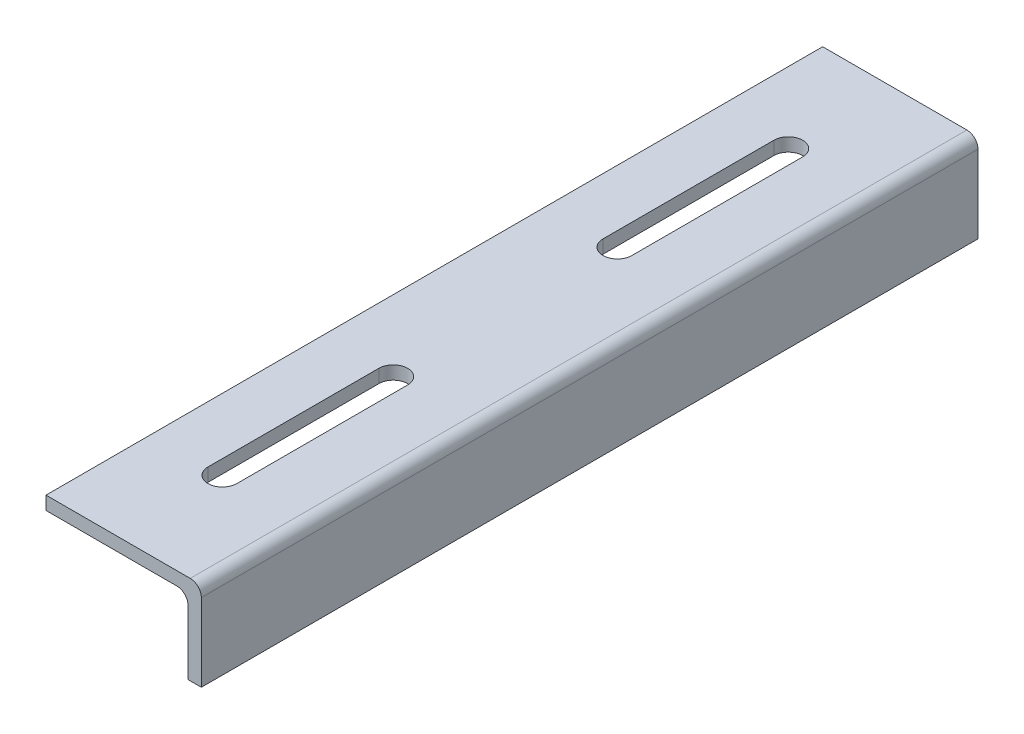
ISO-10303-21;
HEADER;
FILE_DESCRIPTION(('STEP AP214'),'2;1');
FILE_NAME('part.step','',(''),(''),'','','');
FILE_SCHEMA(('AUTOMOTIVE_DESIGN { 1 0 10303 214 1 1 1 1 }'));
ENDSEC;
DATA;
#1=APPLICATION_CONTEXT('core data for automotive mechanical design processes');
#2=APPLICATION_PROTOCOL_DEFINITION('international standard','automotive_design',2000,#1);
#3=PRODUCT_CONTEXT('',#1,'mechanical');
#4=PRODUCT('Part','Part','',(#3));
#5=PRODUCT_RELATED_PRODUCT_CATEGORY('part','',(#4));
#6=PRODUCT_DEFINITION_FORMATION('','',#4);
#7=PRODUCT_DEFINITION_CONTEXT('part definition',#1,'design');
#8=PRODUCT_DEFINITION('design','',#6,#7);
#9=PRODUCT_DEFINITION_SHAPE('','',#8);
#10=(LENGTH_UNIT() NAMED_UNIT(*) SI_UNIT(.MILLI.,.METRE.));
#11=(NAMED_UNIT(*) PLANE_ANGLE_UNIT() SI_UNIT($,.RADIAN.));
#12=(NAMED_UNIT(*) SI_UNIT($,.STERADIAN.) SOLID_ANGLE_UNIT());
#13=UNCERTAINTY_MEASURE_WITH_UNIT(LENGTH_MEASURE(1.E-05),#10,'distance_accuracy_value','');
#14=(GEOMETRIC_REPRESENTATION_CONTEXT(3) GLOBAL_UNCERTAINTY_ASSIGNED_CONTEXT((#13)) GLOBAL_UNIT_ASSIGNED_CONTEXT((#10,
#11,#12)) REPRESENTATION_CONTEXT('',''));
#15=CARTESIAN_POINT('',(0.,0.,0.));
#16=DIRECTION('',(0.,0.,1.));
#17=DIRECTION('',(1.,0.,0.));
#18=AXIS2_PLACEMENT_3D('',#15,#16,#17);
#19=CARTESIAN_POINT('',(-70.0000000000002,-6.00000000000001,350.000000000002));
#20=DIRECTION('',(1.,0.,0.));
#21=DIRECTION('',(0.,0.,-1.));
#22=AXIS2_PLACEMENT_3D('',#19,#20,#21);
#23=PLANE('',#22);
#24=DIRECTION('',(0.,-1.,0.));
#25=VECTOR('',#24,1.);
#26=CARTESIAN_POINT('',(-70.0000000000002,-6.00000000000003,0.));
#27=LINE('',#26,#25);
#28=CARTESIAN_POINT('',(-70.0000000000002,0.,0.));
#29=VERTEX_POINT('',#28);
#30=CARTESIAN_POINT('',(-70.0000000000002,-6.00000000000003,0.));
#31=VERTEX_POINT('',#30);
#32=EDGE_CURVE('E232',#29,#31,#27,.T.);
#33=ORIENTED_EDGE('',*,*,#32,.T.);
#34=DIRECTION('',(0.,0.,-1.));
#35=VECTOR('',#34,1.);
#36=CARTESIAN_POINT('',(-70.0000000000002,-6.00000000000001,350.000000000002));
#37=LINE('',#36,#35);
#38=CARTESIAN_POINT('',(-70.0000000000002,-6.00000000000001,350.000000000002));
#39=VERTEX_POINT('',#38);
#40=EDGE_CURVE('E269',#39,#31,#37,.T.);
#41=ORIENTED_EDGE('',*,*,#40,.F.);
#42=DIRECTION('',(0.,-1.,0.));
#43=VECTOR('',#42,1.);
#44=CARTESIAN_POINT('',(-70.0000000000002,-6.00000000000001,350.000000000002));
#45=LINE('',#44,#43);
#46=CARTESIAN_POINT('',(-70.0000000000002,0.,350.000000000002));
#47=VERTEX_POINT('',#46);
#48=EDGE_CURVE('E246',#47,#39,#45,.T.);
#49=ORIENTED_EDGE('',*,*,#48,.F.);
#50=DIRECTION('',(0.,0.,-1.));
#51=VECTOR('',#50,1.);
#52=CARTESIAN_POINT('',(-70.0000000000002,0.,350.000000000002));
#53=LINE('',#52,#51);
#54=EDGE_CURVE('E260',#47,#29,#53,.T.);
#55=ORIENTED_EDGE('',*,*,#54,.T.);
#56=EDGE_LOOP('',(#33,#41,#49,#55));
#57=FACE_BOUND('',#56,.T.);
#58=ADVANCED_FACE('F43',(#57),#23,.F.);
#59=CARTESIAN_POINT('',(-5.99999999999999,-6.00000000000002,350.000000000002));
#60=DIRECTION('',(0.,1.,0.));
#61=DIRECTION('',(-1.,0.,0.));
#62=AXIS2_PLACEMENT_3D('',#59,#60,#61);
#63=PLANE('',#62);
#64=DIRECTION('',(0.,0.,-1.));
#65=VECTOR('',#64,1.);
#66=CARTESIAN_POINT('',(-31.5000000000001,-6.00000000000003,350.000000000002));
#67=LINE('',#66,#65);
#68=CARTESIAN_POINT('',(-31.5,-6.00000000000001,124.500000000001));
#69=VERTEX_POINT('',#68);
#70=CARTESIAN_POINT('',(-31.5,-6.00000000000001,47.5000000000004));
#71=VERTEX_POINT('',#70);
#72=EDGE_CURVE('E194',#69,#71,#67,.T.);
#73=ORIENTED_EDGE('',*,*,#72,.T.);
#74=CARTESIAN_POINT('',(-38.,-6.00000000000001,47.5000000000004));
#75=DIRECTION('',(0.,1.,0.));
#76=DIRECTION('',(-1.,0.,0.));
#77=AXIS2_PLACEMENT_3D('',#74,#75,#76);
#78=CIRCLE('',#77,6.5);
#79=CARTESIAN_POINT('',(-44.5,-6.00000000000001,47.5000000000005));
#80=VERTEX_POINT('',#79);
#81=EDGE_CURVE('E197',#71,#80,#78,.T.);
#82=ORIENTED_EDGE('',*,*,#81,.T.);
#83=DIRECTION('',(0.,0.,1.));
#84=VECTOR('',#83,1.);
#85=CARTESIAN_POINT('',(-44.5000000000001,-6.00000000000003,350.000000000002));
#86=LINE('',#85,#84);
#87=CARTESIAN_POINT('',(-44.5,-6.00000000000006,124.500000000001));
#88=VERTEX_POINT('',#87);
#89=EDGE_CURVE('E189',#80,#88,#86,.T.);
#90=ORIENTED_EDGE('',*,*,#89,.T.);
#91=CARTESIAN_POINT('',(-38.,-6.00000000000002,124.500000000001));
#92=DIRECTION('',(0.,1.,0.));
#93=DIRECTION('',(-1.,0.,0.));
#94=AXIS2_PLACEMENT_3D('',#91,#92,#93);
#95=CIRCLE('',#94,6.49999999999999);
#96=EDGE_CURVE('E164',#88,#69,#95,.T.);
#97=ORIENTED_EDGE('',*,*,#96,.T.);
#98=EDGE_LOOP('',(#73,#82,#90,#97));
#99=FACE_BOUND('',#98,.T.);
#100=DIRECTION('',(0.,0.,-1.));
#101=VECTOR('',#100,1.);
#102=CARTESIAN_POINT('',(-31.5000000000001,-6.00000000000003,350.000000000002));
#103=LINE('',#102,#101);
#104=CARTESIAN_POINT('',(-31.5000000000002,-6.00000000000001,302.500000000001));
#105=VERTEX_POINT('',#104);
#106=CARTESIAN_POINT('',(-31.5000000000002,-6.00000000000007,225.500000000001));
#107=VERTEX_POINT('',#106);
#108=EDGE_CURVE('E226',#105,#107,#103,.T.);
#109=ORIENTED_EDGE('',*,*,#108,.T.);
#110=CARTESIAN_POINT('',(-38.0000000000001,-6.00000000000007,225.500000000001));
#111=DIRECTION('',(0.,1.,0.));
#112=DIRECTION('',(-1.,0.,0.));
#113=AXIS2_PLACEMENT_3D('',#110,#111,#112);
#114=CIRCLE('',#113,6.5);
#115=CARTESIAN_POINT('',(-44.5000000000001,-6.00000000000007,225.500000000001));
#116=VERTEX_POINT('',#115);
#117=EDGE_CURVE('E229',#107,#116,#114,.T.);
#118=ORIENTED_EDGE('',*,*,#117,.T.);
#119=DIRECTION('',(0.,0.,1.));
#120=VECTOR('',#119,1.);
#121=CARTESIAN_POINT('',(-44.5000000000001,-6.00000000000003,350.000000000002));
#122=LINE('',#121,#120);
#123=CARTESIAN_POINT('',(-44.5000000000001,-6.00000000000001,302.500000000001));
#124=VERTEX_POINT('',#123);
#125=EDGE_CURVE('E214',#116,#124,#122,.T.);
#126=ORIENTED_EDGE('',*,*,#125,.T.);
#127=CARTESIAN_POINT('',(-38.0000000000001,-6.00000000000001,302.500000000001));
#128=DIRECTION('',(0.,1.,0.));
#129=DIRECTION('',(-1.,0.,0.));
#130=AXIS2_PLACEMENT_3D('',#127,#128,#129);
#131=CIRCLE('',#130,6.49999999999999);
#132=EDGE_CURVE('E223',#124,#105,#131,.T.);
#133=ORIENTED_EDGE('',*,*,#132,.T.);
#134=EDGE_LOOP('',(#109,#118,#126,#133));
#135=FACE_BOUND('',#134,.T.);
#136=DIRECTION('',(1.,0.,0.));
#137=VECTOR('',#136,1.);
#138=CARTESIAN_POINT('',(-5.99999999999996,-6.00000000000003,0.));
#139=LINE('',#138,#137);
#140=CARTESIAN_POINT('',(-11.,-6.00000000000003,0.));
#141=VERTEX_POINT('',#140);
#142=EDGE_CURVE('E235',#31,#141,#139,.T.);
#143=ORIENTED_EDGE('',*,*,#142,.T.);
#144=DIRECTION('',(0.,0.,-1.));
#145=VECTOR('',#144,1.);
#146=CARTESIAN_POINT('',(-11.,-6.00000000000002,350.000000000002));
#147=LINE('',#146,#145);
#148=CARTESIAN_POINT('',(-11.,-6.00000000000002,350.000000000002));
#149=VERTEX_POINT('',#148);
#150=EDGE_CURVE('E275',#141,#149,#147,.F.);
#151=ORIENTED_EDGE('',*,*,#150,.T.);
#152=DIRECTION('',(1.,0.,0.));
#153=VECTOR('',#152,1.);
#154=CARTESIAN_POINT('',(-5.99999999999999,-6.00000000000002,350.000000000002));
#155=LINE('',#154,#153);
#156=EDGE_CURVE('E249',#39,#149,#155,.T.);
#157=ORIENTED_EDGE('',*,*,#156,.F.);
#158=ORIENTED_EDGE('',*,*,#40,.T.);
#159=EDGE_LOOP('',(#143,#151,#157,#158));
#160=FACE_BOUND('',#159,.T.);
#161=ADVANCED_FACE('F291',(#99,#135,#160),#63,.F.);
#162=CARTESIAN_POINT('',(-5.99999999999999,-40.,350.000000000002));
#163=DIRECTION('',(1.,0.,0.));
#164=DIRECTION('',(0.,0.,-1.));
#165=AXIS2_PLACEMENT_3D('',#162,#163,#164);
#166=PLANE('',#165);
#167=DIRECTION('',(0.,-1.,0.));
#168=VECTOR('',#167,1.);
#169=CARTESIAN_POINT('',(-5.99999999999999,-40.,350.000000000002));
#170=LINE('',#169,#168);
#171=CARTESIAN_POINT('',(-5.99999999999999,-11.,350.000000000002));
#172=VERTEX_POINT('',#171);
#173=CARTESIAN_POINT('',(-5.99999999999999,-40.,350.000000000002));
#174=VERTEX_POINT('',#173);
#175=EDGE_CURVE('E252',#172,#174,#170,.T.);
#176=ORIENTED_EDGE('',*,*,#175,.F.);
#177=DIRECTION('',(0.,0.,-1.));
#178=VECTOR('',#177,1.);
#179=CARTESIAN_POINT('',(-5.99999999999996,-11.,0.));
#180=LINE('',#179,#178);
#181=CARTESIAN_POINT('',(-5.99999999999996,-11.,0.));
#182=VERTEX_POINT('',#181);
#183=EDGE_CURVE('E272',#172,#182,#180,.T.);
#184=ORIENTED_EDGE('',*,*,#183,.T.);
#185=DIRECTION('',(0.,-1.,0.));
#186=VECTOR('',#185,1.);
#187=CARTESIAN_POINT('',(-5.99999999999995,-40.,0.));
#188=LINE('',#187,#186);
#189=CARTESIAN_POINT('',(-5.99999999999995,-40.,0.));
#190=VERTEX_POINT('',#189);
#191=EDGE_CURVE('E238',#182,#190,#188,.T.);
#192=ORIENTED_EDGE('',*,*,#191,.T.);
#193=DIRECTION('',(0.,0.,-1.));
#194=VECTOR('',#193,1.);
#195=CARTESIAN_POINT('',(-5.99999999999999,-40.,350.000000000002));
#196=LINE('',#195,#194);
#197=EDGE_CURVE('E266',#174,#190,#196,.T.);
#198=ORIENTED_EDGE('',*,*,#197,.F.);
#199=EDGE_LOOP('',(#176,#184,#192,#198));
#200=FACE_BOUND('',#199,.T.);
#201=ADVANCED_FACE('F300',(#200),#166,.F.);
#202=CARTESIAN_POINT('',(0.,-40.,350.000000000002));
#203=DIRECTION('',(0.,1.,0.));
#204=DIRECTION('',(0.,0.,1.));
#205=AXIS2_PLACEMENT_3D('',#202,#203,#204);
#206=PLANE('',#205);
#207=DIRECTION('',(1.,0.,0.));
#208=VECTOR('',#207,1.);
#209=CARTESIAN_POINT('',(0.,-40.,0.));
#210=LINE('',#209,#208);
#211=CARTESIAN_POINT('',(0.,-40.,0.));
#212=VERTEX_POINT('',#211);
#213=EDGE_CURVE('E240',#190,#212,#210,.T.);
#214=ORIENTED_EDGE('',*,*,#213,.T.);
#215=DIRECTION('',(0.,0.,-1.));
#216=VECTOR('',#215,1.);
#217=CARTESIAN_POINT('',(0.,-40.,350.000000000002));
#218=LINE('',#217,#216);
#219=CARTESIAN_POINT('',(0.,-40.,350.000000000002));
#220=VERTEX_POINT('',#219);
#221=EDGE_CURVE('E263',#220,#212,#218,.T.);
#222=ORIENTED_EDGE('',*,*,#221,.F.);
#223=DIRECTION('',(1.,0.,0.));
#224=VECTOR('',#223,1.);
#225=CARTESIAN_POINT('',(0.,-40.,350.000000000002));
#226=LINE('',#225,#224);
#227=EDGE_CURVE('E254',#174,#220,#226,.T.);
#228=ORIENTED_EDGE('',*,*,#227,.F.);
#229=ORIENTED_EDGE('',*,*,#197,.T.);
#230=EDGE_LOOP('',(#214,#222,#228,#229));
#231=FACE_BOUND('',#230,.T.);
#232=ADVANCED_FACE('F304',(#231),#206,.F.);
#233=CARTESIAN_POINT('',(0.,0.,350.000000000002));
#234=DIRECTION('',(-1.,0.,0.));
#235=DIRECTION('',(0.,-1.,0.));
#236=AXIS2_PLACEMENT_3D('',#233,#234,#235);
#237=PLANE('',#236);
#238=DIRECTION('',(0.,1.,0.));
#239=VECTOR('',#238,1.);
#240=CARTESIAN_POINT('',(0.,0.,0.));
#241=LINE('',#240,#239);
#242=CARTESIAN_POINT('',(0.,-5.00000000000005,0.));
#243=VERTEX_POINT('',#242);
#244=EDGE_CURVE('E242',#212,#243,#241,.T.);
#245=ORIENTED_EDGE('',*,*,#244,.T.);
#246=DIRECTION('',(0.,0.,-1.));
#247=VECTOR('',#246,1.);
#248=CARTESIAN_POINT('',(0.,-5.00000000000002,350.000000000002));
#249=LINE('',#248,#247);
#250=CARTESIAN_POINT('',(0.,-5.00000000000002,350.000000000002));
#251=VERTEX_POINT('',#250);
#252=EDGE_CURVE('E57',#243,#251,#249,.F.);
#253=ORIENTED_EDGE('',*,*,#252,.T.);
#254=DIRECTION('',(0.,1.,0.));
#255=VECTOR('',#254,1.);
#256=CARTESIAN_POINT('',(0.,0.,350.000000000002));
#257=LINE('',#256,#255);
#258=EDGE_CURVE('E256',#220,#251,#257,.T.);
#259=ORIENTED_EDGE('',*,*,#258,.F.);
#260=ORIENTED_EDGE('',*,*,#221,.T.);
#261=EDGE_LOOP('',(#245,#253,#259,#260));
#262=FACE_BOUND('',#261,.T.);
#263=ADVANCED_FACE('F327',(#262),#237,.F.);
#264=CARTESIAN_POINT('',(-70.0000000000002,0.,350.000000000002));
#265=DIRECTION('',(0.,-1.,0.));
#266=DIRECTION('',(0.,0.,-1.));
#267=AXIS2_PLACEMENT_3D('',#264,#265,#266);
#268=PLANE('',#267);
#269=DIRECTION('',(0.,0.,1.));
#270=VECTOR('',#269,1.);
#271=CARTESIAN_POINT('',(-44.5,0.,47.5000000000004));
#272=LINE('',#271,#270);
#273=CARTESIAN_POINT('',(-44.5,0.,47.5000000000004));
#274=VERTEX_POINT('',#273);
#275=CARTESIAN_POINT('',(-44.5,0.,124.500000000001));
#276=VERTEX_POINT('',#275);
#277=EDGE_CURVE('E172',#274,#276,#272,.T.);
#278=ORIENTED_EDGE('',*,*,#277,.F.);
#279=CARTESIAN_POINT('',(-38.,0.,47.5000000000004));
#280=DIRECTION('',(0.,1.,0.));
#281=DIRECTION('',(0.,0.,1.));
#282=AXIS2_PLACEMENT_3D('',#279,#280,#281);
#283=CIRCLE('',#282,6.5);
#284=CARTESIAN_POINT('',(-31.5000000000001,0.,47.5000000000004));
#285=VERTEX_POINT('',#284);
#286=EDGE_CURVE('E177',#285,#274,#283,.T.);
#287=ORIENTED_EDGE('',*,*,#286,.F.);
#288=DIRECTION('',(0.,0.,-1.));
#289=VECTOR('',#288,1.);
#290=CARTESIAN_POINT('',(-31.5000000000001,0.,47.5000000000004));
#291=LINE('',#290,#289);
#292=CARTESIAN_POINT('',(-31.5000000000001,0.,124.500000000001));
#293=VERTEX_POINT('',#292);
#294=EDGE_CURVE('E182',#293,#285,#291,.T.);
#295=ORIENTED_EDGE('',*,*,#294,.F.);
#296=CARTESIAN_POINT('',(-38.,0.,124.500000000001));
#297=DIRECTION('',(0.,1.,0.));
#298=DIRECTION('',(0.,0.,1.));
#299=AXIS2_PLACEMENT_3D('',#296,#297,#298);
#300=CIRCLE('',#299,6.49999999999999);
#301=EDGE_CURVE('E161',#276,#293,#300,.T.);
#302=ORIENTED_EDGE('',*,*,#301,.F.);
#303=EDGE_LOOP('',(#278,#287,#295,#302));
#304=FACE_BOUND('',#303,.T.);
#305=DIRECTION('',(0.,0.,1.));
#306=VECTOR('',#305,1.);
#307=CARTESIAN_POINT('',(-44.5000000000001,0.,225.500000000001));
#308=LINE('',#307,#306);
#309=CARTESIAN_POINT('',(-44.5000000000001,0.,225.500000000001));
#310=VERTEX_POINT('',#309);
#311=CARTESIAN_POINT('',(-44.5000000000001,0.,302.500000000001));
#312=VERTEX_POINT('',#311);
#313=EDGE_CURVE('E202',#310,#312,#308,.T.);
#314=ORIENTED_EDGE('',*,*,#313,.F.);
#315=CARTESIAN_POINT('',(-38.0000000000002,0.,225.500000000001));
#316=DIRECTION('',(0.,1.,0.));
#317=DIRECTION('',(0.,0.,1.));
#318=AXIS2_PLACEMENT_3D('',#315,#316,#317);
#319=CIRCLE('',#318,6.5);
#320=CARTESIAN_POINT('',(-31.5000000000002,0.,225.500000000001));
#321=VERTEX_POINT('',#320);
#322=EDGE_CURVE('E200',#321,#310,#319,.T.);
#323=ORIENTED_EDGE('',*,*,#322,.F.);
#324=DIRECTION('',(0.,0.,-1.));
#325=VECTOR('',#324,1.);
#326=CARTESIAN_POINT('',(-31.5000000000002,0.,225.500000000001));
#327=LINE('',#326,#325);
#328=CARTESIAN_POINT('',(-31.5000000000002,0.,302.500000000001));
#329=VERTEX_POINT('',#328);
#330=EDGE_CURVE('E208',#329,#321,#327,.T.);
#331=ORIENTED_EDGE('',*,*,#330,.F.);
#332=CARTESIAN_POINT('',(-38.0000000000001,0.,302.500000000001));
#333=DIRECTION('',(0.,1.,0.));
#334=DIRECTION('',(0.,0.,1.));
#335=AXIS2_PLACEMENT_3D('',#332,#333,#334);
#336=CIRCLE('',#335,6.49999999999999);
#337=EDGE_CURVE('E205',#312,#329,#336,.T.);
#338=ORIENTED_EDGE('',*,*,#337,.F.);
#339=EDGE_LOOP('',(#314,#323,#331,#338));
#340=FACE_BOUND('',#339,.T.);
#341=DIRECTION('',(-1.,0.,0.));
#342=VECTOR('',#341,1.);
#343=CARTESIAN_POINT('',(-70.0000000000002,0.,350.000000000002));
#344=LINE('',#343,#342);
#345=CARTESIAN_POINT('',(-5.00000000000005,0.,350.000000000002));
#346=VERTEX_POINT('',#345);
#347=EDGE_CURVE('E258',#346,#47,#344,.T.);
#348=ORIENTED_EDGE('',*,*,#347,.F.);
#349=DIRECTION('',(0.,0.,-1.));
#350=VECTOR('',#349,1.);
#351=CARTESIAN_POINT('',(-5.00000000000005,0.,350.000000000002));
#352=LINE('',#351,#350);
#353=CARTESIAN_POINT('',(-5.,0.,0.));
#354=VERTEX_POINT('',#353);
#355=EDGE_CURVE('E277',#346,#354,#352,.T.);
#356=ORIENTED_EDGE('',*,*,#355,.T.);
#357=DIRECTION('',(-1.,0.,0.));
#358=VECTOR('',#357,1.);
#359=CARTESIAN_POINT('',(-70.0000000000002,0.,0.));
#360=LINE('',#359,#358);
#361=EDGE_CURVE('E244',#354,#29,#360,.T.);
#362=ORIENTED_EDGE('',*,*,#361,.T.);
#363=ORIENTED_EDGE('',*,*,#54,.F.);
#364=EDGE_LOOP('',(#348,#356,#362,#363));
#365=FACE_BOUND('',#364,.T.);
#366=ADVANCED_FACE('F179',(#304,#340,#365),#268,.F.);
#367=CARTESIAN_POINT('',(-70.0000000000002,0.,350.000000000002));
#368=DIRECTION('',(0.,0.,-1.));
#369=DIRECTION('',(-1.,0.,0.));
#370=AXIS2_PLACEMENT_3D('',#367,#368,#369);
#371=PLANE('',#370);
#372=ORIENTED_EDGE('',*,*,#258,.T.);
#373=CARTESIAN_POINT('',(-5.00000000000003,-5.00000000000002,350.000000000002));
#374=DIRECTION('',(0.,0.,-1.));
#375=DIRECTION('',(-1.,0.,0.));
#376=AXIS2_PLACEMENT_3D('',#373,#374,#375);
#377=CIRCLE('',#376,5.);
#378=EDGE_CURVE('E282',#251,#346,#377,.F.);
#379=ORIENTED_EDGE('',*,*,#378,.T.);
#380=ORIENTED_EDGE('',*,*,#347,.T.);
#381=ORIENTED_EDGE('',*,*,#48,.T.);
#382=ORIENTED_EDGE('',*,*,#156,.T.);
#383=CARTESIAN_POINT('',(-11.,-11.0000000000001,350.000000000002));
#384=DIRECTION('',(0.,0.,-1.));
#385=DIRECTION('',(-1.,0.,0.));
#386=AXIS2_PLACEMENT_3D('',#383,#384,#385);
#387=CIRCLE('',#386,5.);
#388=EDGE_CURVE('E11',#149,#172,#387,.T.);
#389=ORIENTED_EDGE('',*,*,#388,.T.);
#390=ORIENTED_EDGE('',*,*,#175,.T.);
#391=ORIENTED_EDGE('',*,*,#227,.T.);
#392=EDGE_LOOP('',(#372,#379,#380,#381,#382,#389,#390,#391));
#393=FACE_BOUND('',#392,.T.);
#394=ADVANCED_FACE('F297',(#393),#371,.F.);
#395=CARTESIAN_POINT('',(-70.0000000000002,0.,0.));
#396=DIRECTION('',(0.,0.,-1.));
#397=DIRECTION('',(-1.,0.,0.));
#398=AXIS2_PLACEMENT_3D('',#395,#396,#397);
#399=PLANE('',#398);
#400=ORIENTED_EDGE('',*,*,#361,.F.);
#401=CARTESIAN_POINT('',(-5.,-5.00000000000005,0.));
#402=DIRECTION('',(0.,0.,-1.));
#403=DIRECTION('',(-1.,0.,0.));
#404=AXIS2_PLACEMENT_3D('',#401,#402,#403);
#405=CIRCLE('',#404,5.);
#406=EDGE_CURVE('E65',#354,#243,#405,.T.);
#407=ORIENTED_EDGE('',*,*,#406,.T.);
#408=ORIENTED_EDGE('',*,*,#244,.F.);
#409=ORIENTED_EDGE('',*,*,#213,.F.);
#410=ORIENTED_EDGE('',*,*,#191,.F.);
#411=CARTESIAN_POINT('',(-11.,-11.,0.));
#412=DIRECTION('',(0.,0.,-1.));
#413=DIRECTION('',(-1.,0.,0.));
#414=AXIS2_PLACEMENT_3D('',#411,#412,#413);
#415=CIRCLE('',#414,5.);
#416=EDGE_CURVE('E50',#182,#141,#415,.F.);
#417=ORIENTED_EDGE('',*,*,#416,.T.);
#418=ORIENTED_EDGE('',*,*,#142,.F.);
#419=ORIENTED_EDGE('',*,*,#32,.F.);
#420=EDGE_LOOP('',(#400,#407,#408,#409,#410,#417,#418,#419));
#421=FACE_BOUND('',#420,.T.);
#422=ADVANCED_FACE('F284',(#421),#399,.T.);
#423=CARTESIAN_POINT('',(-38.,-350.000000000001,225.500000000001));
#424=DIRECTION('',(0.,1.,0.));
#425=DIRECTION('',(0.,0.,1.));
#426=AXIS2_PLACEMENT_3D('',#423,#424,#425);
#427=CYLINDRICAL_SURFACE('',#426,6.5);
#428=DIRECTION('',(0.,1.,0.));
#429=VECTOR('',#428,1.);
#430=CARTESIAN_POINT('',(-31.5000000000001,-350.000000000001,225.500000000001));
#431=LINE('',#430,#429);
#432=EDGE_CURVE('E212',#107,#321,#431,.T.);
#433=ORIENTED_EDGE('',*,*,#432,.T.);
#434=ORIENTED_EDGE('',*,*,#322,.T.);
#435=DIRECTION('',(0.,1.,0.));
#436=VECTOR('',#435,1.);
#437=CARTESIAN_POINT('',(-44.5,-350.000000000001,225.500000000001));
#438=LINE('',#437,#436);
#439=EDGE_CURVE('E211',#116,#310,#438,.T.);
#440=ORIENTED_EDGE('',*,*,#439,.F.);
#441=ORIENTED_EDGE('',*,*,#117,.F.);
#442=EDGE_LOOP('',(#433,#434,#440,#441));
#443=FACE_BOUND('',#442,.T.);
#444=ADVANCED_FACE('F336',(#443),#427,.F.);
#445=CARTESIAN_POINT('',(-31.5000000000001,-350.000000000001,225.500000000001));
#446=DIRECTION('',(1.,0.,0.));
#447=DIRECTION('',(0.,0.,-1.));
#448=AXIS2_PLACEMENT_3D('',#445,#446,#447);
#449=PLANE('',#448);
#450=DIRECTION('',(0.,1.,0.));
#451=VECTOR('',#450,1.);
#452=CARTESIAN_POINT('',(-31.5,-350.000000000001,302.500000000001));
#453=LINE('',#452,#451);
#454=EDGE_CURVE('E215',#105,#329,#453,.T.);
#455=ORIENTED_EDGE('',*,*,#454,.T.);
#456=ORIENTED_EDGE('',*,*,#330,.T.);
#457=ORIENTED_EDGE('',*,*,#432,.F.);
#458=ORIENTED_EDGE('',*,*,#108,.F.);
#459=EDGE_LOOP('',(#455,#456,#457,#458));
#460=FACE_BOUND('',#459,.T.);
#461=ADVANCED_FACE('F339',(#460),#449,.F.);
#462=CARTESIAN_POINT('',(-38.,-350.000000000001,302.500000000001));
#463=DIRECTION('',(0.,1.,0.));
#464=DIRECTION('',(0.,0.,1.));
#465=AXIS2_PLACEMENT_3D('',#462,#463,#464);
#466=CYLINDRICAL_SURFACE('',#465,6.49999999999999);
#467=DIRECTION('',(0.,1.,0.));
#468=VECTOR('',#467,1.);
#469=CARTESIAN_POINT('',(-44.5,-350.000000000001,302.500000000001));
#470=LINE('',#469,#468);
#471=EDGE_CURVE('E217',#124,#312,#470,.T.);
#472=ORIENTED_EDGE('',*,*,#471,.T.);
#473=ORIENTED_EDGE('',*,*,#337,.T.);
#474=ORIENTED_EDGE('',*,*,#454,.F.);
#475=ORIENTED_EDGE('',*,*,#132,.F.);
#476=EDGE_LOOP('',(#472,#473,#474,#475));
#477=FACE_BOUND('',#476,.T.);
#478=ADVANCED_FACE('F345',(#477),#466,.F.);
#479=CARTESIAN_POINT('',(-44.5,-350.000000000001,225.500000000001));
#480=DIRECTION('',(-1.,0.,0.));
#481=DIRECTION('',(0.,0.,1.));
#482=AXIS2_PLACEMENT_3D('',#479,#480,#481);
#483=PLANE('',#482);
#484=ORIENTED_EDGE('',*,*,#439,.T.);
#485=ORIENTED_EDGE('',*,*,#313,.T.);
#486=ORIENTED_EDGE('',*,*,#471,.F.);
#487=ORIENTED_EDGE('',*,*,#125,.F.);
#488=EDGE_LOOP('',(#484,#485,#486,#487));
#489=FACE_BOUND('',#488,.T.);
#490=ADVANCED_FACE('F341',(#489),#483,.F.);
#491=CARTESIAN_POINT('',(-37.9999999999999,-350.000000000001,47.5000000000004));
#492=DIRECTION('',(0.,1.,0.));
#493=DIRECTION('',(0.,0.,1.));
#494=AXIS2_PLACEMENT_3D('',#491,#492,#493);
#495=CYLINDRICAL_SURFACE('',#494,6.5);
#496=DIRECTION('',(0.,1.,0.));
#497=VECTOR('',#496,1.);
#498=CARTESIAN_POINT('',(-31.4999999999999,-350.000000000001,47.5000000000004));
#499=LINE('',#498,#497);
#500=EDGE_CURVE('E187',#71,#285,#499,.T.);
#501=ORIENTED_EDGE('',*,*,#500,.T.);
#502=ORIENTED_EDGE('',*,*,#286,.T.);
#503=DIRECTION('',(0.,1.,0.));
#504=VECTOR('',#503,1.);
#505=CARTESIAN_POINT('',(-44.4999999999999,-350.000000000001,47.5000000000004));
#506=LINE('',#505,#504);
#507=EDGE_CURVE('E168',#80,#274,#506,.T.);
#508=ORIENTED_EDGE('',*,*,#507,.F.);
#509=ORIENTED_EDGE('',*,*,#81,.F.);
#510=EDGE_LOOP('',(#501,#502,#508,#509));
#511=FACE_BOUND('',#510,.T.);
#512=ADVANCED_FACE('F344',(#511),#495,.F.);
#513=CARTESIAN_POINT('',(-31.4999999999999,-350.000000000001,47.5000000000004));
#514=DIRECTION('',(1.,0.,0.));
#515=DIRECTION('',(0.,0.,-1.));
#516=AXIS2_PLACEMENT_3D('',#513,#514,#515);
#517=PLANE('',#516);
#518=DIRECTION('',(0.,1.,0.));
#519=VECTOR('',#518,1.);
#520=CARTESIAN_POINT('',(-31.4999999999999,-350.000000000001,124.500000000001));
#521=LINE('',#520,#519);
#522=EDGE_CURVE('E167',#69,#293,#521,.T.);
#523=ORIENTED_EDGE('',*,*,#522,.T.);
#524=ORIENTED_EDGE('',*,*,#294,.T.);
#525=ORIENTED_EDGE('',*,*,#500,.F.);
#526=ORIENTED_EDGE('',*,*,#72,.F.);
#527=EDGE_LOOP('',(#523,#524,#525,#526));
#528=FACE_BOUND('',#527,.T.);
#529=ADVANCED_FACE('F355',(#528),#517,.F.);
#530=CARTESIAN_POINT('',(-37.9999999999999,-350.000000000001,124.500000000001));
#531=DIRECTION('',(0.,1.,0.));
#532=DIRECTION('',(0.,0.,1.));
#533=AXIS2_PLACEMENT_3D('',#530,#531,#532);
#534=CYLINDRICAL_SURFACE('',#533,6.49999999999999);
#535=DIRECTION('',(0.,1.,0.));
#536=VECTOR('',#535,1.);
#537=CARTESIAN_POINT('',(-44.4999999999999,-350.000000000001,124.500000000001));
#538=LINE('',#537,#536);
#539=EDGE_CURVE('E156',#88,#276,#538,.T.);
#540=ORIENTED_EDGE('',*,*,#539,.T.);
#541=ORIENTED_EDGE('',*,*,#301,.T.);
#542=ORIENTED_EDGE('',*,*,#522,.F.);
#543=ORIENTED_EDGE('',*,*,#96,.F.);
#544=EDGE_LOOP('',(#540,#541,#542,#543));
#545=FACE_BOUND('',#544,.T.);
#546=ADVANCED_FACE('F158',(#545),#534,.F.);
#547=CARTESIAN_POINT('',(-44.4999999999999,-350.000000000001,47.5000000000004));
#548=DIRECTION('',(-1.,0.,0.));
#549=DIRECTION('',(0.,0.,1.));
#550=AXIS2_PLACEMENT_3D('',#547,#548,#549);
#551=PLANE('',#550);
#552=ORIENTED_EDGE('',*,*,#507,.T.);
#553=ORIENTED_EDGE('',*,*,#277,.T.);
#554=ORIENTED_EDGE('',*,*,#539,.F.);
#555=ORIENTED_EDGE('',*,*,#89,.F.);
#556=EDGE_LOOP('',(#552,#553,#554,#555));
#557=FACE_BOUND('',#556,.T.);
#558=ADVANCED_FACE('F173',(#557),#551,.F.);
#559=CARTESIAN_POINT('',(-11.,-11.0000000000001,350.000000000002));
#560=DIRECTION('',(0.,0.,1.));
#561=DIRECTION('',(1.,0.,0.));
#562=AXIS2_PLACEMENT_3D('',#559,#560,#561);
#563=CYLINDRICAL_SURFACE('',#562,5.);
#564=ORIENTED_EDGE('',*,*,#388,.F.);
#565=ORIENTED_EDGE('',*,*,#150,.F.);
#566=ORIENTED_EDGE('',*,*,#416,.F.);
#567=ORIENTED_EDGE('',*,*,#183,.F.);
#568=EDGE_LOOP('',(#564,#565,#566,#567));
#569=FACE_BOUND('',#568,.T.);
#570=ADVANCED_FACE('F294',(#569),#563,.F.);
#571=CARTESIAN_POINT('',(-5.00000000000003,-5.00000000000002,350.000000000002));
#572=DIRECTION('',(0.,0.,-1.));
#573=DIRECTION('',(-1.,0.,0.));
#574=AXIS2_PLACEMENT_3D('',#571,#572,#573);
#575=CYLINDRICAL_SURFACE('',#574,5.);
#576=ORIENTED_EDGE('',*,*,#378,.F.);
#577=ORIENTED_EDGE('',*,*,#252,.F.);
#578=ORIENTED_EDGE('',*,*,#406,.F.);
#579=ORIENTED_EDGE('',*,*,#355,.F.);
#580=EDGE_LOOP('',(#576,#577,#578,#579));
#581=FACE_BOUND('',#580,.T.);
#582=ADVANCED_FACE('F309',(#581),#575,.T.);
#583=CLOSED_SHELL('',(#58,#161,#201,#232,#263,#366,#394,#422,#444,#461,#478,#490,#512,#529,#546,
#558,#570,#582));
#584=MANIFOLD_SOLID_BREP('B2',#583);
#585=ADVANCED_BREP_SHAPE_REPRESENTATION('',(#18,#584),#14);
#586=SHAPE_DEFINITION_REPRESENTATION(#9,#585);
ENDSEC;
END-ISO-10303-21;
